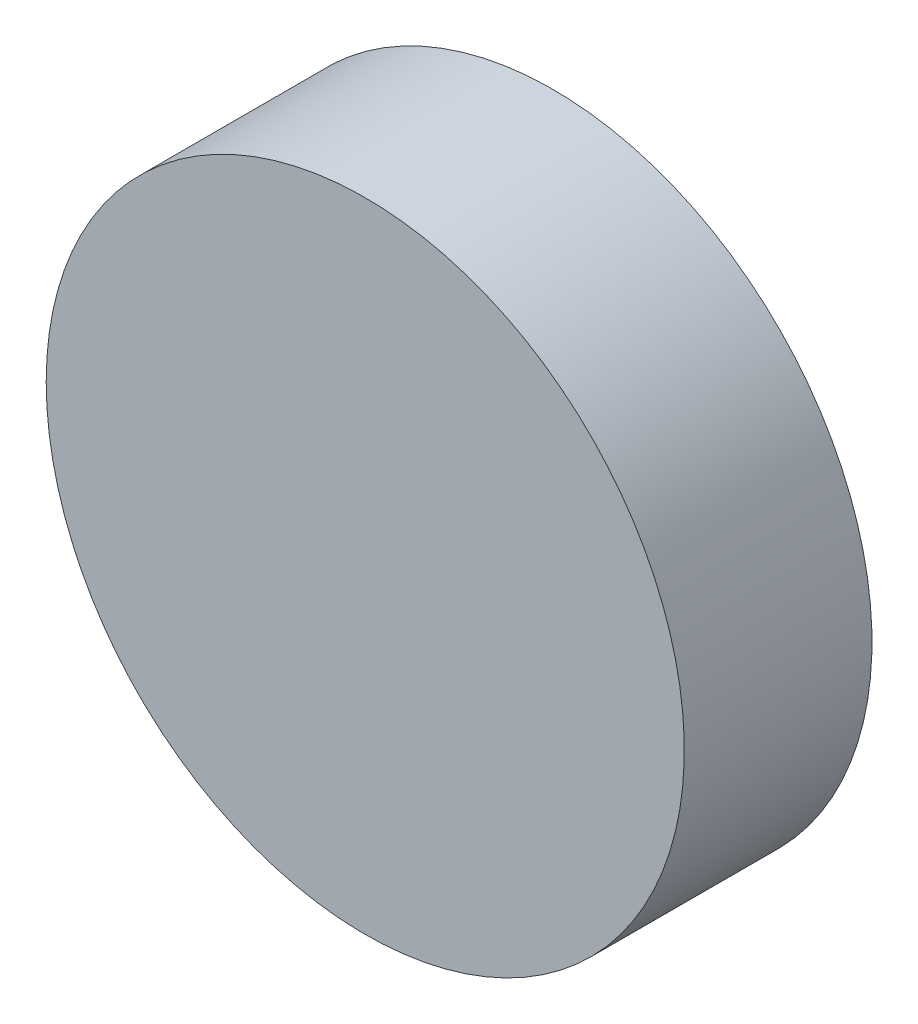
ISO-10303-21;
HEADER;
FILE_DESCRIPTION(('STEP AP214'),'2;1');
FILE_NAME('part.step','',(''),(''),'','','');
FILE_SCHEMA(('AUTOMOTIVE_DESIGN { 1 0 10303 214 1 1 1 1 }'));
ENDSEC;
DATA;
#1=APPLICATION_CONTEXT('core data for automotive mechanical design processes');
#2=APPLICATION_PROTOCOL_DEFINITION('international standard','automotive_design',2000,#1);
#3=PRODUCT_CONTEXT('',#1,'mechanical');
#4=PRODUCT('Part','Part','',(#3));
#5=PRODUCT_RELATED_PRODUCT_CATEGORY('part','',(#4));
#6=PRODUCT_DEFINITION_FORMATION('','',#4);
#7=PRODUCT_DEFINITION_CONTEXT('part definition',#1,'design');
#8=PRODUCT_DEFINITION('design','',#6,#7);
#9=PRODUCT_DEFINITION_SHAPE('','',#8);
#10=(LENGTH_UNIT() NAMED_UNIT(*) SI_UNIT(.MILLI.,.METRE.));
#11=(NAMED_UNIT(*) PLANE_ANGLE_UNIT() SI_UNIT($,.RADIAN.));
#12=(NAMED_UNIT(*) SI_UNIT($,.STERADIAN.) SOLID_ANGLE_UNIT());
#13=UNCERTAINTY_MEASURE_WITH_UNIT(LENGTH_MEASURE(1.E-05),#10,'distance_accuracy_value','');
#14=(GEOMETRIC_REPRESENTATION_CONTEXT(3) GLOBAL_UNCERTAINTY_ASSIGNED_CONTEXT((#13)) GLOBAL_UNIT_ASSIGNED_CONTEXT((#10,
#11,#12)) REPRESENTATION_CONTEXT('',''));
#15=CARTESIAN_POINT('',(0.,0.,0.));
#16=DIRECTION('',(0.,0.,1.));
#17=DIRECTION('',(1.,0.,0.));
#18=AXIS2_PLACEMENT_3D('',#15,#16,#17);
#19=CARTESIAN_POINT('',(0.,0.,0.));
#20=DIRECTION('',(0.,0.,1.));
#21=DIRECTION('',(1.,0.,0.));
#22=AXIS2_PLACEMENT_3D('',#19,#20,#21);
#23=PLANE('',#22);
#24=CARTESIAN_POINT('',(0.,0.,0.));
#25=DIRECTION('',(0.,0.,-1.));
#26=DIRECTION('',(-1.,0.,0.));
#27=AXIS2_PLACEMENT_3D('',#24,#25,#26);
#28=CIRCLE('',#27,3.4);
#29=CARTESIAN_POINT('',(-3.4,0.,0.));
#30=VERTEX_POINT('',#29);
#31=EDGE_CURVE('E18',#30,#30,#28,.F.);
#32=ORIENTED_EDGE('',*,*,#31,.F.);
#33=EDGE_LOOP('',(#32));
#34=FACE_BOUND('',#33,.T.);
#35=ADVANCED_FACE('F15',(#34),#23,.F.);
#36=CARTESIAN_POINT('',(0.,0.,2.));
#37=DIRECTION('',(0.,0.,-1.));
#38=DIRECTION('',(-1.,0.,0.));
#39=AXIS2_PLACEMENT_3D('',#36,#37,#38);
#40=CYLINDRICAL_SURFACE('',#39,3.4);
#41=ORIENTED_EDGE('',*,*,#31,.T.);
#42=EDGE_LOOP('',(#41));
#43=FACE_BOUND('',#42,.T.);
#44=CARTESIAN_POINT('',(0.,0.,2.));
#45=DIRECTION('',(0.,0.,-1.));
#46=DIRECTION('',(-1.,0.,0.));
#47=AXIS2_PLACEMENT_3D('',#44,#45,#46);
#48=CIRCLE('',#47,3.4);
#49=CARTESIAN_POINT('',(-3.4,0.,2.));
#50=VERTEX_POINT('',#49);
#51=EDGE_CURVE('E10',#50,#50,#48,.F.);
#52=ORIENTED_EDGE('',*,*,#51,.F.);
#53=EDGE_LOOP('',(#52));
#54=FACE_BOUND('',#53,.T.);
#55=ADVANCED_FACE('F27',(#43,#54),#40,.T.);
#56=CARTESIAN_POINT('',(0.,0.,2.));
#57=DIRECTION('',(0.,0.,1.));
#58=DIRECTION('',(1.,0.,0.));
#59=AXIS2_PLACEMENT_3D('',#56,#57,#58);
#60=PLANE('',#59);
#61=ORIENTED_EDGE('',*,*,#51,.T.);
#62=EDGE_LOOP('',(#61));
#63=FACE_BOUND('',#62,.T.);
#64=ADVANCED_FACE('F35',(#63),#60,.T.);
#65=CLOSED_SHELL('',(#35,#55,#64));
#66=MANIFOLD_SOLID_BREP('B1',#65);
#67=ADVANCED_BREP_SHAPE_REPRESENTATION('',(#18,#66),#14);
#68=SHAPE_DEFINITION_REPRESENTATION(#9,#67);
ENDSEC;
END-ISO-10303-21;
